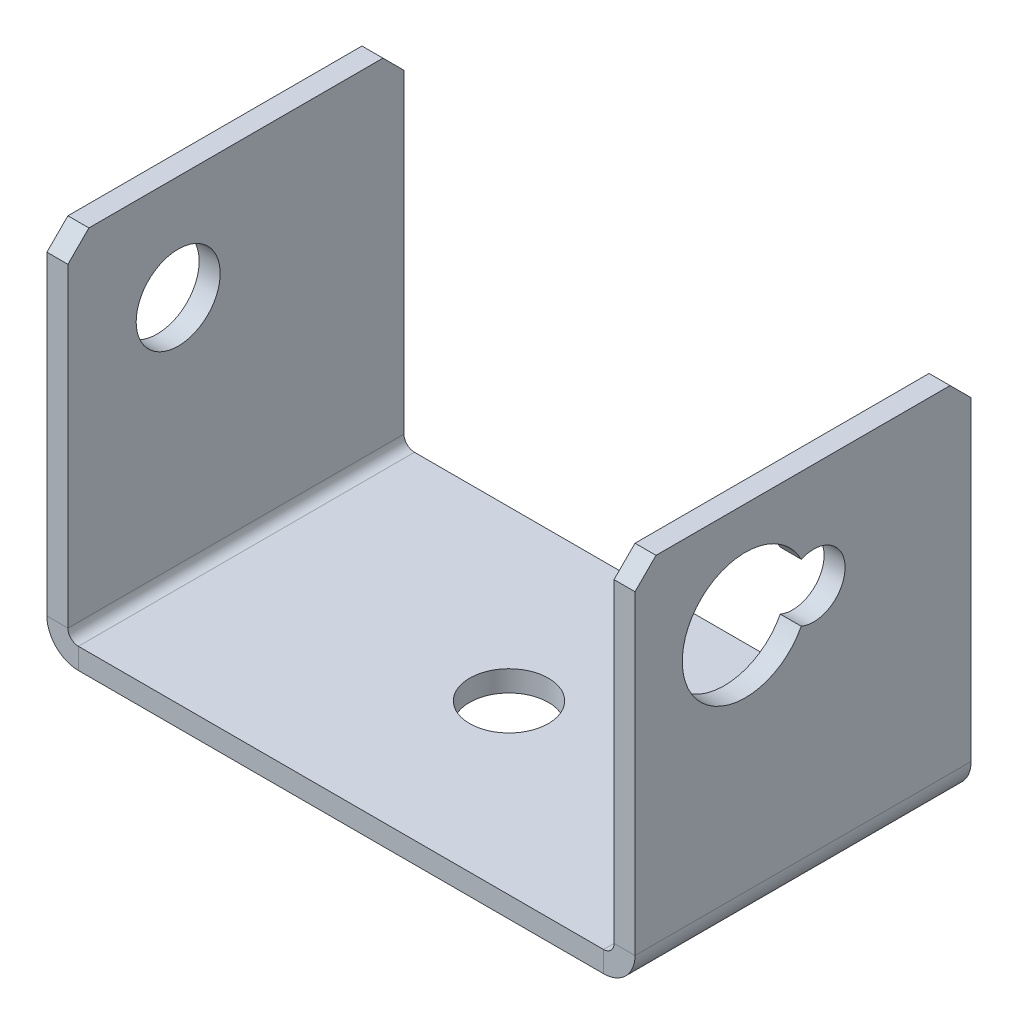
ISO-10303-21;
HEADER;
FILE_DESCRIPTION(('STEP AP214'),'2;1');
FILE_NAME('part.step','',(''),(''),'','','');
FILE_SCHEMA(('AUTOMOTIVE_DESIGN { 1 0 10303 214 1 1 1 1 }'));
ENDSEC;
DATA;
#1=APPLICATION_CONTEXT('core data for automotive mechanical design processes');
#2=APPLICATION_PROTOCOL_DEFINITION('international standard','automotive_design',2000,#1);
#3=PRODUCT_CONTEXT('',#1,'mechanical');
#4=PRODUCT('Part','Part','',(#3));
#5=PRODUCT_RELATED_PRODUCT_CATEGORY('part','',(#4));
#6=PRODUCT_DEFINITION_FORMATION('','',#4);
#7=PRODUCT_DEFINITION_CONTEXT('part definition',#1,'design');
#8=PRODUCT_DEFINITION('design','',#6,#7);
#9=PRODUCT_DEFINITION_SHAPE('','',#8);
#10=(LENGTH_UNIT() NAMED_UNIT(*) SI_UNIT(.MILLI.,.METRE.));
#11=(NAMED_UNIT(*) PLANE_ANGLE_UNIT() SI_UNIT($,.RADIAN.));
#12=(NAMED_UNIT(*) SI_UNIT($,.STERADIAN.) SOLID_ANGLE_UNIT());
#13=UNCERTAINTY_MEASURE_WITH_UNIT(LENGTH_MEASURE(1.E-05),#10,'distance_accuracy_value','');
#14=(GEOMETRIC_REPRESENTATION_CONTEXT(3) GLOBAL_UNCERTAINTY_ASSIGNED_CONTEXT((#13)) GLOBAL_UNIT_ASSIGNED_CONTEXT((#10,
#11,#12)) REPRESENTATION_CONTEXT('',''));
#15=CARTESIAN_POINT('',(0.,0.,0.));
#16=DIRECTION('',(0.,0.,1.));
#17=DIRECTION('',(1.,0.,0.));
#18=AXIS2_PLACEMENT_3D('',#15,#16,#17);
#19=CARTESIAN_POINT('',(3.,0.,-32.));
#20=DIRECTION('',(0.,0.,-1.));
#21=DIRECTION('',(-1.,0.,0.));
#22=AXIS2_PLACEMENT_3D('',#19,#20,#21);
#23=PLANE('',#22);
#24=DIRECTION('',(0.,1.,0.));
#25=VECTOR('',#24,1.);
#26=CARTESIAN_POINT('',(3.,0.,-32.));
#27=LINE('',#26,#25);
#28=CARTESIAN_POINT('',(3.,0.,-32.));
#29=VERTEX_POINT('',#28);
#30=CARTESIAN_POINT('',(3.,2.,-32.));
#31=VERTEX_POINT('',#30);
#32=EDGE_CURVE('E305',#29,#31,#27,.T.);
#33=ORIENTED_EDGE('',*,*,#32,.F.);
#34=CARTESIAN_POINT('',(3.,3.,-32.));
#35=DIRECTION('',(0.,0.,-1.));
#36=DIRECTION('',(-1.,0.,0.));
#37=AXIS2_PLACEMENT_3D('',#34,#35,#36);
#38=CIRCLE('',#37,3.);
#39=CARTESIAN_POINT('',(0.,3.,-32.));
#40=VERTEX_POINT('',#39);
#41=EDGE_CURVE('E220',#40,#29,#38,.F.);
#42=ORIENTED_EDGE('',*,*,#41,.F.);
#43=DIRECTION('',(-1.,0.,0.));
#44=VECTOR('',#43,1.);
#45=CARTESIAN_POINT('',(2.,3.,-32.));
#46=LINE('',#45,#44);
#47=CARTESIAN_POINT('',(2.,3.,-32.));
#48=VERTEX_POINT('',#47);
#49=EDGE_CURVE('E302',#48,#40,#46,.T.);
#50=ORIENTED_EDGE('',*,*,#49,.F.);
#51=CARTESIAN_POINT('',(3.,3.,-32.));
#52=DIRECTION('',(0.,0.,1.));
#53=DIRECTION('',(1.,0.,0.));
#54=AXIS2_PLACEMENT_3D('',#51,#52,#53);
#55=CIRCLE('',#54,1.);
#56=EDGE_CURVE('E213',#48,#31,#55,.T.);
#57=ORIENTED_EDGE('',*,*,#56,.T.);
#58=EDGE_LOOP('',(#33,#42,#50,#57));
#59=FACE_BOUND('',#58,.T.);
#60=ADVANCED_FACE('F42',(#59),#23,.T.);
#61=CARTESIAN_POINT('',(2.,3.,-32.));
#62=DIRECTION('',(0.,0.,-1.));
#63=DIRECTION('',(-1.,0.,0.));
#64=AXIS2_PLACEMENT_3D('',#61,#62,#63);
#65=PLANE('',#64);
#66=DIRECTION('',(1.,0.,0.));
#67=VECTOR('',#66,1.);
#68=CARTESIAN_POINT('',(0.,0.,-32.));
#69=LINE('',#68,#67);
#70=CARTESIAN_POINT('',(53.,0.,-32.));
#71=VERTEX_POINT('',#70);
#72=EDGE_CURVE('E223',#29,#71,#69,.T.);
#73=ORIENTED_EDGE('',*,*,#72,.F.);
#74=ORIENTED_EDGE('',*,*,#32,.T.);
#75=DIRECTION('',(1.,0.,0.));
#76=VECTOR('',#75,1.);
#77=CARTESIAN_POINT('',(0.,2.,-32.));
#78=LINE('',#77,#76);
#79=CARTESIAN_POINT('',(53.,2.,-32.));
#80=VERTEX_POINT('',#79);
#81=EDGE_CURVE('E210',#31,#80,#78,.T.);
#82=ORIENTED_EDGE('',*,*,#81,.T.);
#83=DIRECTION('',(0.,-1.,0.));
#84=VECTOR('',#83,1.);
#85=CARTESIAN_POINT('',(53.,2.,-32.));
#86=LINE('',#85,#84);
#87=EDGE_CURVE('E293',#80,#71,#86,.T.);
#88=ORIENTED_EDGE('',*,*,#87,.T.);
#89=EDGE_LOOP('',(#73,#74,#82,#88));
#90=FACE_BOUND('',#89,.T.);
#91=ADVANCED_FACE('F368',(#90),#65,.T.);
#92=CARTESIAN_POINT('',(0.,3.,0.));
#93=DIRECTION('',(0.,0.,1.));
#94=DIRECTION('',(1.,0.,0.));
#95=AXIS2_PLACEMENT_3D('',#92,#93,#94);
#96=PLANE('',#95);
#97=DIRECTION('',(1.,0.,0.));
#98=VECTOR('',#97,1.);
#99=CARTESIAN_POINT('',(0.,3.,0.));
#100=LINE('',#99,#98);
#101=CARTESIAN_POINT('',(0.,3.,0.));
#102=VERTEX_POINT('',#101);
#103=CARTESIAN_POINT('',(2.,3.,0.));
#104=VERTEX_POINT('',#103);
#105=EDGE_CURVE('E299',#102,#104,#100,.T.);
#106=ORIENTED_EDGE('',*,*,#105,.F.);
#107=CARTESIAN_POINT('',(3.,3.,0.));
#108=DIRECTION('',(0.,0.,-1.));
#109=DIRECTION('',(-1.,0.,0.));
#110=AXIS2_PLACEMENT_3D('',#107,#108,#109);
#111=CIRCLE('',#110,3.);
#112=CARTESIAN_POINT('',(3.,0.,0.));
#113=VERTEX_POINT('',#112);
#114=EDGE_CURVE('E246',#102,#113,#111,.F.);
#115=ORIENTED_EDGE('',*,*,#114,.T.);
#116=DIRECTION('',(0.,-1.,0.));
#117=VECTOR('',#116,1.);
#118=CARTESIAN_POINT('',(3.,2.,0.));
#119=LINE('',#118,#117);
#120=CARTESIAN_POINT('',(3.,2.,0.));
#121=VERTEX_POINT('',#120);
#122=EDGE_CURVE('E297',#121,#113,#119,.T.);
#123=ORIENTED_EDGE('',*,*,#122,.F.);
#124=CARTESIAN_POINT('',(3.,3.,0.));
#125=DIRECTION('',(0.,0.,1.));
#126=DIRECTION('',(1.,0.,0.));
#127=AXIS2_PLACEMENT_3D('',#124,#125,#126);
#128=CIRCLE('',#127,1.);
#129=EDGE_CURVE('E239',#104,#121,#128,.T.);
#130=ORIENTED_EDGE('',*,*,#129,.F.);
#131=EDGE_LOOP('',(#106,#115,#123,#130));
#132=FACE_BOUND('',#131,.T.);
#133=ADVANCED_FACE('F374',(#132),#96,.T.);
#134=CARTESIAN_POINT('',(3.,2.,0.));
#135=DIRECTION('',(0.,0.,1.));
#136=DIRECTION('',(1.,0.,0.));
#137=AXIS2_PLACEMENT_3D('',#134,#135,#136);
#138=PLANE('',#137);
#139=DIRECTION('',(0.,1.,0.));
#140=VECTOR('',#139,1.);
#141=CARTESIAN_POINT('',(2.,0.,0.));
#142=LINE('',#141,#140);
#143=CARTESIAN_POINT('',(2.,33.,0.));
#144=VERTEX_POINT('',#143);
#145=EDGE_CURVE('E242',#144,#104,#142,.F.);
#146=ORIENTED_EDGE('',*,*,#145,.F.);
#147=DIRECTION('',(-1.,0.,0.));
#148=VECTOR('',#147,1.);
#149=CARTESIAN_POINT('',(0.,33.,0.));
#150=LINE('',#149,#148);
#151=CARTESIAN_POINT('',(0.,33.,0.));
#152=VERTEX_POINT('',#151);
#153=EDGE_CURVE('E326',#144,#152,#150,.T.);
#154=ORIENTED_EDGE('',*,*,#153,.T.);
#155=DIRECTION('',(0.,-1.,0.));
#156=VECTOR('',#155,1.);
#157=CARTESIAN_POINT('',(0.,0.,0.));
#158=LINE('',#157,#156);
#159=EDGE_CURVE('E244',#152,#102,#158,.T.);
#160=ORIENTED_EDGE('',*,*,#159,.T.);
#161=ORIENTED_EDGE('',*,*,#105,.T.);
#162=EDGE_LOOP('',(#146,#154,#160,#161));
#163=FACE_BOUND('',#162,.T.);
#164=ADVANCED_FACE('F449',(#163),#138,.T.);
#165=CARTESIAN_POINT('',(56.,3.,-32.));
#166=DIRECTION('',(0.,0.,-1.));
#167=DIRECTION('',(-1.,0.,0.));
#168=AXIS2_PLACEMENT_3D('',#165,#166,#167);
#169=PLANE('',#168);
#170=DIRECTION('',(-1.,0.,0.));
#171=VECTOR('',#170,1.);
#172=CARTESIAN_POINT('',(56.,3.,-32.));
#173=LINE('',#172,#171);
#174=CARTESIAN_POINT('',(56.,3.,-32.));
#175=VERTEX_POINT('',#174);
#176=CARTESIAN_POINT('',(54.,3.,-32.));
#177=VERTEX_POINT('',#176);
#178=EDGE_CURVE('E295',#175,#177,#173,.T.);
#179=ORIENTED_EDGE('',*,*,#178,.F.);
#180=CARTESIAN_POINT('',(53.,3.,-32.));
#181=DIRECTION('',(0.,0.,-1.));
#182=DIRECTION('',(-1.,0.,0.));
#183=AXIS2_PLACEMENT_3D('',#180,#181,#182);
#184=CIRCLE('',#183,3.);
#185=EDGE_CURVE('E226',#71,#175,#184,.F.);
#186=ORIENTED_EDGE('',*,*,#185,.F.);
#187=ORIENTED_EDGE('',*,*,#87,.F.);
#188=CARTESIAN_POINT('',(53.,3.,-32.));
#189=DIRECTION('',(0.,0.,1.));
#190=DIRECTION('',(1.,0.,0.));
#191=AXIS2_PLACEMENT_3D('',#188,#189,#190);
#192=CIRCLE('',#191,1.);
#193=EDGE_CURVE('E207',#80,#177,#192,.T.);
#194=ORIENTED_EDGE('',*,*,#193,.T.);
#195=EDGE_LOOP('',(#179,#186,#187,#194));
#196=FACE_BOUND('',#195,.T.);
#197=ADVANCED_FACE('F447',(#196),#169,.T.);
#198=CARTESIAN_POINT('',(53.,2.,-32.));
#199=DIRECTION('',(0.,0.,-1.));
#200=DIRECTION('',(-1.,0.,0.));
#201=AXIS2_PLACEMENT_3D('',#198,#199,#200);
#202=PLANE('',#201);
#203=DIRECTION('',(0.,1.,0.));
#204=VECTOR('',#203,1.);
#205=CARTESIAN_POINT('',(54.,0.,-32.));
#206=LINE('',#205,#204);
#207=CARTESIAN_POINT('',(54.,33.,-32.));
#208=VERTEX_POINT('',#207);
#209=EDGE_CURVE('E204',#177,#208,#206,.T.);
#210=ORIENTED_EDGE('',*,*,#209,.T.);
#211=DIRECTION('',(1.,0.,0.));
#212=VECTOR('',#211,1.);
#213=CARTESIAN_POINT('',(56.,33.,-32.));
#214=LINE('',#213,#212);
#215=CARTESIAN_POINT('',(56.,33.,-32.));
#216=VERTEX_POINT('',#215);
#217=EDGE_CURVE('E11',#208,#216,#214,.T.);
#218=ORIENTED_EDGE('',*,*,#217,.T.);
#219=DIRECTION('',(0.,1.,0.));
#220=VECTOR('',#219,1.);
#221=CARTESIAN_POINT('',(56.,0.,-32.));
#222=LINE('',#221,#220);
#223=EDGE_CURVE('E201',#175,#216,#222,.T.);
#224=ORIENTED_EDGE('',*,*,#223,.F.);
#225=ORIENTED_EDGE('',*,*,#178,.T.);
#226=EDGE_LOOP('',(#210,#218,#224,#225));
#227=FACE_BOUND('',#226,.T.);
#228=ADVANCED_FACE('F359',(#227),#202,.T.);
#229=CARTESIAN_POINT('',(53.,0.,0.));
#230=DIRECTION('',(0.,0.,1.));
#231=DIRECTION('',(1.,0.,0.));
#232=AXIS2_PLACEMENT_3D('',#229,#230,#231);
#233=PLANE('',#232);
#234=DIRECTION('',(0.,1.,0.));
#235=VECTOR('',#234,1.);
#236=CARTESIAN_POINT('',(53.,0.,0.));
#237=LINE('',#236,#235);
#238=CARTESIAN_POINT('',(53.,0.,0.));
#239=VERTEX_POINT('',#238);
#240=CARTESIAN_POINT('',(53.,2.,0.));
#241=VERTEX_POINT('',#240);
#242=EDGE_CURVE('E291',#239,#241,#237,.T.);
#243=ORIENTED_EDGE('',*,*,#242,.F.);
#244=CARTESIAN_POINT('',(53.,3.,0.));
#245=DIRECTION('',(0.,0.,-1.));
#246=DIRECTION('',(-1.,0.,0.));
#247=AXIS2_PLACEMENT_3D('',#244,#245,#246);
#248=CIRCLE('',#247,3.);
#249=CARTESIAN_POINT('',(56.,3.,0.));
#250=VERTEX_POINT('',#249);
#251=EDGE_CURVE('E205',#239,#250,#248,.F.);
#252=ORIENTED_EDGE('',*,*,#251,.T.);
#253=DIRECTION('',(1.,0.,0.));
#254=VECTOR('',#253,1.);
#255=CARTESIAN_POINT('',(54.,3.,0.));
#256=LINE('',#255,#254);
#257=CARTESIAN_POINT('',(54.,3.,0.));
#258=VERTEX_POINT('',#257);
#259=EDGE_CURVE('E257',#258,#250,#256,.T.);
#260=ORIENTED_EDGE('',*,*,#259,.F.);
#261=CARTESIAN_POINT('',(53.,3.,0.));
#262=DIRECTION('',(0.,0.,1.));
#263=DIRECTION('',(1.,0.,0.));
#264=AXIS2_PLACEMENT_3D('',#261,#262,#263);
#265=CIRCLE('',#264,1.);
#266=EDGE_CURVE('E233',#241,#258,#265,.T.);
#267=ORIENTED_EDGE('',*,*,#266,.F.);
#268=EDGE_LOOP('',(#243,#252,#260,#267));
#269=FACE_BOUND('',#268,.T.);
#270=ADVANCED_FACE('F455',(#269),#233,.T.);
#271=CARTESIAN_POINT('',(54.,3.,0.));
#272=DIRECTION('',(0.,0.,1.));
#273=DIRECTION('',(1.,0.,0.));
#274=AXIS2_PLACEMENT_3D('',#271,#272,#273);
#275=PLANE('',#274);
#276=DIRECTION('',(1.,0.,0.));
#277=VECTOR('',#276,1.);
#278=CARTESIAN_POINT('',(0.,0.,0.));
#279=LINE('',#278,#277);
#280=EDGE_CURVE('E249',#113,#239,#279,.T.);
#281=ORIENTED_EDGE('',*,*,#280,.T.);
#282=ORIENTED_EDGE('',*,*,#242,.T.);
#283=DIRECTION('',(1.,0.,0.));
#284=VECTOR('',#283,1.);
#285=CARTESIAN_POINT('',(0.,2.,0.));
#286=LINE('',#285,#284);
#287=EDGE_CURVE('E236',#121,#241,#286,.T.);
#288=ORIENTED_EDGE('',*,*,#287,.F.);
#289=ORIENTED_EDGE('',*,*,#122,.T.);
#290=EDGE_LOOP('',(#281,#282,#288,#289));
#291=FACE_BOUND('',#290,.T.);
#292=ADVANCED_FACE('F434',(#291),#275,.T.);
#293=CARTESIAN_POINT('',(56.,0.,-32.));
#294=DIRECTION('',(1.,0.,0.));
#295=DIRECTION('',(0.,0.,-1.));
#296=AXIS2_PLACEMENT_3D('',#293,#294,#295);
#297=PLANE('',#296);
#298=CARTESIAN_POINT('',(56.,25.,-17.));
#299=DIRECTION('',(1.,0.,0.));
#300=DIRECTION('',(0.,0.,-1.));
#301=AXIS2_PLACEMENT_3D('',#298,#299,#300);
#302=CIRCLE('',#301,2.99999999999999);
#303=CARTESIAN_POINT('',(56.,22.238860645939,-15.8269230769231));
#304=VERTEX_POINT('',#303);
#305=CARTESIAN_POINT('',(56.,27.761139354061,-15.8269230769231));
#306=VERTEX_POINT('',#305);
#307=EDGE_CURVE('E176',#304,#306,#302,.T.);
#308=ORIENTED_EDGE('',*,*,#307,.F.);
#309=CARTESIAN_POINT('',(56.,25.,-10.5));
#310=DIRECTION('',(1.,0.,0.));
#311=DIRECTION('',(0.,0.,-1.));
#312=AXIS2_PLACEMENT_3D('',#309,#310,#311);
#313=CIRCLE('',#312,6.);
#314=EDGE_CURVE('E186',#306,#304,#313,.T.);
#315=ORIENTED_EDGE('',*,*,#314,.F.);
#316=EDGE_LOOP('',(#308,#315));
#317=FACE_BOUND('',#316,.T.);
#318=DIRECTION('',(0.,0.,1.));
#319=VECTOR('',#318,1.);
#320=CARTESIAN_POINT('',(56.,35.,-32.));
#321=LINE('',#320,#319);
#322=CARTESIAN_POINT('',(56.,35.,-30.));
#323=VERTEX_POINT('',#322);
#324=CARTESIAN_POINT('',(56.,35.,-2.));
#325=VERTEX_POINT('',#324);
#326=EDGE_CURVE('E229',#323,#325,#321,.T.);
#327=ORIENTED_EDGE('',*,*,#326,.T.);
#328=DIRECTION('',(0.,-0.707106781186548,0.707106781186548));
#329=VECTOR('',#328,1.);
#330=CARTESIAN_POINT('',(56.,32.5,0.5));
#331=LINE('',#330,#329);
#332=CARTESIAN_POINT('',(56.,33.,0.));
#333=VERTEX_POINT('',#332);
#334=EDGE_CURVE('E335',#325,#333,#331,.T.);
#335=ORIENTED_EDGE('',*,*,#334,.T.);
#336=DIRECTION('',(0.,1.,0.));
#337=VECTOR('',#336,1.);
#338=CARTESIAN_POINT('',(56.,0.,0.));
#339=LINE('',#338,#337);
#340=EDGE_CURVE('E182',#250,#333,#339,.T.);
#341=ORIENTED_EDGE('',*,*,#340,.F.);
#342=DIRECTION('',(0.,0.,1.));
#343=VECTOR('',#342,1.);
#344=CARTESIAN_POINT('',(56.,3.,-32.));
#345=LINE('',#344,#343);
#346=EDGE_CURVE('E254',#175,#250,#345,.T.);
#347=ORIENTED_EDGE('',*,*,#346,.F.);
#348=ORIENTED_EDGE('',*,*,#223,.T.);
#349=DIRECTION('',(0.,0.707106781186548,0.707106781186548));
#350=VECTOR('',#349,1.);
#351=CARTESIAN_POINT('',(56.,16.5,-48.5));
#352=LINE('',#351,#350);
#353=EDGE_CURVE('E333',#216,#323,#352,.T.);
#354=ORIENTED_EDGE('',*,*,#353,.T.);
#355=EDGE_LOOP('',(#327,#335,#341,#347,#348,#354));
#356=FACE_BOUND('',#355,.T.);
#357=ADVANCED_FACE('F190',(#317,#356),#297,.T.);
#358=CARTESIAN_POINT('',(53.,3.,-32.));
#359=DIRECTION('',(0.,0.,1.));
#360=DIRECTION('',(1.,0.,0.));
#361=AXIS2_PLACEMENT_3D('',#358,#359,#360);
#362=CYLINDRICAL_SURFACE('',#361,3.);
#363=ORIENTED_EDGE('',*,*,#251,.F.);
#364=DIRECTION('',(0.,0.,1.));
#365=VECTOR('',#364,1.);
#366=CARTESIAN_POINT('',(53.,0.,-32.));
#367=LINE('',#366,#365);
#368=EDGE_CURVE('E258',#71,#239,#367,.T.);
#369=ORIENTED_EDGE('',*,*,#368,.F.);
#370=ORIENTED_EDGE('',*,*,#185,.T.);
#371=ORIENTED_EDGE('',*,*,#346,.T.);
#372=EDGE_LOOP('',(#363,#369,#370,#371));
#373=FACE_BOUND('',#372,.T.);
#374=ADVANCED_FACE('F354',(#373),#362,.T.);
#375=CARTESIAN_POINT('',(0.,0.,-32.));
#376=DIRECTION('',(0.,-1.,0.));
#377=DIRECTION('',(0.,0.,-1.));
#378=AXIS2_PLACEMENT_3D('',#375,#376,#377);
#379=PLANE('',#378);
#380=CARTESIAN_POINT('',(28.,0.,-16.));
#381=DIRECTION('',(0.,-1.,0.));
#382=DIRECTION('',(0.,0.,-1.));
#383=AXIS2_PLACEMENT_3D('',#380,#381,#382);
#384=CIRCLE('',#383,3.75);
#385=CARTESIAN_POINT('',(28.,0.,-19.75));
#386=VERTEX_POINT('',#385);
#387=EDGE_CURVE('E795',#386,#386,#384,.T.);
#388=ORIENTED_EDGE('',*,*,#387,.F.);
#389=EDGE_LOOP('',(#388));
#390=FACE_BOUND('',#389,.T.);
#391=ORIENTED_EDGE('',*,*,#280,.F.);
#392=DIRECTION('',(0.,0.,1.));
#393=VECTOR('',#392,1.);
#394=CARTESIAN_POINT('',(3.,0.,-32.));
#395=LINE('',#394,#393);
#396=EDGE_CURVE('E261',#29,#113,#395,.T.);
#397=ORIENTED_EDGE('',*,*,#396,.F.);
#398=ORIENTED_EDGE('',*,*,#72,.T.);
#399=ORIENTED_EDGE('',*,*,#368,.T.);
#400=EDGE_LOOP('',(#391,#397,#398,#399));
#401=FACE_BOUND('',#400,.T.);
#402=ADVANCED_FACE('F429',(#390,#401),#379,.T.);
#403=CARTESIAN_POINT('',(3.,3.,-32.));
#404=DIRECTION('',(0.,0.,1.));
#405=DIRECTION('',(1.,0.,0.));
#406=AXIS2_PLACEMENT_3D('',#403,#404,#405);
#407=CYLINDRICAL_SURFACE('',#406,3.);
#408=ORIENTED_EDGE('',*,*,#114,.F.);
#409=DIRECTION('',(0.,0.,1.));
#410=VECTOR('',#409,1.);
#411=CARTESIAN_POINT('',(0.,3.,-32.));
#412=LINE('',#411,#410);
#413=EDGE_CURVE('E264',#40,#102,#412,.T.);
#414=ORIENTED_EDGE('',*,*,#413,.F.);
#415=ORIENTED_EDGE('',*,*,#41,.T.);
#416=ORIENTED_EDGE('',*,*,#396,.T.);
#417=EDGE_LOOP('',(#408,#414,#415,#416));
#418=FACE_BOUND('',#417,.T.);
#419=ADVANCED_FACE('F422',(#418),#407,.T.);
#420=CARTESIAN_POINT('',(0.,0.,-32.));
#421=DIRECTION('',(-1.,0.,0.));
#422=DIRECTION('',(0.,0.,1.));
#423=AXIS2_PLACEMENT_3D('',#420,#421,#422);
#424=PLANE('',#423);
#425=CARTESIAN_POINT('',(0.,25.,-10.5));
#426=DIRECTION('',(-1.,0.,0.));
#427=DIRECTION('',(0.,0.,1.));
#428=AXIS2_PLACEMENT_3D('',#425,#426,#427);
#429=CIRCLE('',#428,4.);
#430=CARTESIAN_POINT('',(0.,25.,-6.5));
#431=VERTEX_POINT('',#430);
#432=EDGE_CURVE('E195',#431,#431,#429,.T.);
#433=ORIENTED_EDGE('',*,*,#432,.F.);
#434=EDGE_LOOP('',(#433));
#435=FACE_BOUND('',#434,.T.);
#436=DIRECTION('',(0.,0.,1.));
#437=VECTOR('',#436,1.);
#438=CARTESIAN_POINT('',(0.,35.,-32.));
#439=LINE('',#438,#437);
#440=CARTESIAN_POINT('',(0.,35.,-30.));
#441=VERTEX_POINT('',#440);
#442=CARTESIAN_POINT('',(0.,35.,-2.));
#443=VERTEX_POINT('',#442);
#444=EDGE_CURVE('E267',#441,#443,#439,.T.);
#445=ORIENTED_EDGE('',*,*,#444,.F.);
#446=DIRECTION('',(0.,0.707106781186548,0.707106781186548));
#447=VECTOR('',#446,1.);
#448=CARTESIAN_POINT('',(0.,16.5,-48.5));
#449=LINE('',#448,#447);
#450=CARTESIAN_POINT('',(0.,33.,-32.));
#451=VERTEX_POINT('',#450);
#452=EDGE_CURVE('E324',#441,#451,#449,.F.);
#453=ORIENTED_EDGE('',*,*,#452,.T.);
#454=DIRECTION('',(0.,-1.,0.));
#455=VECTOR('',#454,1.);
#456=CARTESIAN_POINT('',(0.,0.,-32.));
#457=LINE('',#456,#455);
#458=EDGE_CURVE('E218',#451,#40,#457,.T.);
#459=ORIENTED_EDGE('',*,*,#458,.T.);
#460=ORIENTED_EDGE('',*,*,#413,.T.);
#461=ORIENTED_EDGE('',*,*,#159,.F.);
#462=DIRECTION('',(0.,0.707106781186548,-0.707106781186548));
#463=VECTOR('',#462,1.);
#464=CARTESIAN_POINT('',(0.,32.5,0.5));
#465=LINE('',#464,#463);
#466=EDGE_CURVE('E322',#152,#443,#465,.T.);
#467=ORIENTED_EDGE('',*,*,#466,.T.);
#468=EDGE_LOOP('',(#445,#453,#459,#460,#461,#467));
#469=FACE_BOUND('',#468,.T.);
#470=ADVANCED_FACE('F405',(#435,#469),#424,.T.);
#471=CARTESIAN_POINT('',(0.,35.,-32.));
#472=DIRECTION('',(0.,-1.,0.));
#473=DIRECTION('',(0.,0.,-1.));
#474=AXIS2_PLACEMENT_3D('',#471,#472,#473);
#475=PLANE('',#474);
#476=DIRECTION('',(0.,0.,1.));
#477=VECTOR('',#476,1.);
#478=CARTESIAN_POINT('',(2.,35.,-32.));
#479=LINE('',#478,#477);
#480=CARTESIAN_POINT('',(2.,35.,-30.));
#481=VERTEX_POINT('',#480);
#482=CARTESIAN_POINT('',(2.,35.,-2.));
#483=VERTEX_POINT('',#482);
#484=EDGE_CURVE('E270',#481,#483,#479,.T.);
#485=ORIENTED_EDGE('',*,*,#484,.F.);
#486=DIRECTION('',(-1.,0.,0.));
#487=VECTOR('',#486,1.);
#488=CARTESIAN_POINT('',(0.,35.,-30.));
#489=LINE('',#488,#487);
#490=EDGE_CURVE('E320',#481,#441,#489,.T.);
#491=ORIENTED_EDGE('',*,*,#490,.T.);
#492=ORIENTED_EDGE('',*,*,#444,.T.);
#493=DIRECTION('',(1.,0.,0.));
#494=VECTOR('',#493,1.);
#495=CARTESIAN_POINT('',(2.,35.,-2.));
#496=LINE('',#495,#494);
#497=EDGE_CURVE('E317',#443,#483,#496,.T.);
#498=ORIENTED_EDGE('',*,*,#497,.T.);
#499=EDGE_LOOP('',(#485,#491,#492,#498));
#500=FACE_BOUND('',#499,.T.);
#501=ADVANCED_FACE('F409',(#500),#475,.F.);
#502=CARTESIAN_POINT('',(2.,0.,-32.));
#503=DIRECTION('',(-1.,0.,0.));
#504=DIRECTION('',(0.,0.,1.));
#505=AXIS2_PLACEMENT_3D('',#502,#503,#504);
#506=PLANE('',#505);
#507=CARTESIAN_POINT('',(2.,25.,-10.5));
#508=DIRECTION('',(-1.,0.,0.));
#509=DIRECTION('',(0.,0.,1.));
#510=AXIS2_PLACEMENT_3D('',#507,#508,#509);
#511=CIRCLE('',#510,4.);
#512=CARTESIAN_POINT('',(2.,25.,-6.5));
#513=VERTEX_POINT('',#512);
#514=EDGE_CURVE('E192',#513,#513,#511,.T.);
#515=ORIENTED_EDGE('',*,*,#514,.T.);
#516=EDGE_LOOP('',(#515));
#517=FACE_BOUND('',#516,.T.);
#518=DIRECTION('',(0.,1.,0.));
#519=VECTOR('',#518,1.);
#520=CARTESIAN_POINT('',(2.,0.,-32.));
#521=LINE('',#520,#519);
#522=CARTESIAN_POINT('',(2.,33.,-32.));
#523=VERTEX_POINT('',#522);
#524=EDGE_CURVE('E216',#523,#48,#521,.F.);
#525=ORIENTED_EDGE('',*,*,#524,.F.);
#526=DIRECTION('',(0.,-0.707106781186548,-0.707106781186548));
#527=VECTOR('',#526,1.);
#528=CARTESIAN_POINT('',(2.,33.,-32.));
#529=LINE('',#528,#527);
#530=EDGE_CURVE('E315',#523,#481,#529,.F.);
#531=ORIENTED_EDGE('',*,*,#530,.T.);
#532=ORIENTED_EDGE('',*,*,#484,.T.);
#533=DIRECTION('',(0.,-0.707106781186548,0.707106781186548));
#534=VECTOR('',#533,1.);
#535=CARTESIAN_POINT('',(2.,35.,-2.));
#536=LINE('',#535,#534);
#537=EDGE_CURVE('E313',#483,#144,#536,.T.);
#538=ORIENTED_EDGE('',*,*,#537,.T.);
#539=ORIENTED_EDGE('',*,*,#145,.T.);
#540=DIRECTION('',(0.,0.,1.));
#541=VECTOR('',#540,1.);
#542=CARTESIAN_POINT('',(2.,3.,-32.));
#543=LINE('',#542,#541);
#544=EDGE_CURVE('E273',#48,#104,#543,.T.);
#545=ORIENTED_EDGE('',*,*,#544,.F.);
#546=EDGE_LOOP('',(#525,#531,#532,#538,#539,#545));
#547=FACE_BOUND('',#546,.T.);
#548=ADVANCED_FACE('F519',(#517,#547),#506,.F.);
#549=CARTESIAN_POINT('',(3.,3.,-32.));
#550=DIRECTION('',(0.,0.,1.));
#551=DIRECTION('',(1.,0.,0.));
#552=AXIS2_PLACEMENT_3D('',#549,#550,#551);
#553=CYLINDRICAL_SURFACE('',#552,1.);
#554=ORIENTED_EDGE('',*,*,#129,.T.);
#555=DIRECTION('',(0.,0.,1.));
#556=VECTOR('',#555,1.);
#557=CARTESIAN_POINT('',(3.,2.,-32.));
#558=LINE('',#557,#556);
#559=EDGE_CURVE('E276',#31,#121,#558,.T.);
#560=ORIENTED_EDGE('',*,*,#559,.F.);
#561=ORIENTED_EDGE('',*,*,#56,.F.);
#562=ORIENTED_EDGE('',*,*,#544,.T.);
#563=EDGE_LOOP('',(#554,#560,#561,#562));
#564=FACE_BOUND('',#563,.T.);
#565=ADVANCED_FACE('F440',(#564),#553,.F.);
#566=CARTESIAN_POINT('',(0.,2.,-32.));
#567=DIRECTION('',(0.,-1.,0.));
#568=DIRECTION('',(0.,0.,-1.));
#569=AXIS2_PLACEMENT_3D('',#566,#567,#568);
#570=PLANE('',#569);
#571=CARTESIAN_POINT('',(28.,2.,-16.));
#572=DIRECTION('',(0.,1.,0.));
#573=DIRECTION('',(0.,0.,1.));
#574=AXIS2_PLACEMENT_3D('',#571,#572,#573);
#575=CIRCLE('',#574,3.75);
#576=CARTESIAN_POINT('',(28.,2.,-12.25));
#577=VERTEX_POINT('',#576);
#578=EDGE_CURVE('E796',#577,#577,#575,.T.);
#579=ORIENTED_EDGE('',*,*,#578,.F.);
#580=EDGE_LOOP('',(#579));
#581=FACE_BOUND('',#580,.T.);
#582=ORIENTED_EDGE('',*,*,#287,.T.);
#583=DIRECTION('',(0.,0.,1.));
#584=VECTOR('',#583,1.);
#585=CARTESIAN_POINT('',(53.,2.,-32.));
#586=LINE('',#585,#584);
#587=EDGE_CURVE('E279',#80,#241,#586,.T.);
#588=ORIENTED_EDGE('',*,*,#587,.F.);
#589=ORIENTED_EDGE('',*,*,#81,.F.);
#590=ORIENTED_EDGE('',*,*,#559,.T.);
#591=EDGE_LOOP('',(#582,#588,#589,#590));
#592=FACE_BOUND('',#591,.T.);
#593=ADVANCED_FACE('F442',(#581,#592),#570,.F.);
#594=CARTESIAN_POINT('',(53.,3.,-32.));
#595=DIRECTION('',(0.,0.,1.));
#596=DIRECTION('',(1.,0.,0.));
#597=AXIS2_PLACEMENT_3D('',#594,#595,#596);
#598=CYLINDRICAL_SURFACE('',#597,1.);
#599=ORIENTED_EDGE('',*,*,#266,.T.);
#600=DIRECTION('',(0.,0.,1.));
#601=VECTOR('',#600,1.);
#602=CARTESIAN_POINT('',(54.,3.,-32.));
#603=LINE('',#602,#601);
#604=EDGE_CURVE('E282',#177,#258,#603,.T.);
#605=ORIENTED_EDGE('',*,*,#604,.F.);
#606=ORIENTED_EDGE('',*,*,#193,.F.);
#607=ORIENTED_EDGE('',*,*,#587,.T.);
#608=EDGE_LOOP('',(#599,#605,#606,#607));
#609=FACE_BOUND('',#608,.T.);
#610=ADVANCED_FACE('F446',(#609),#598,.F.);
#611=CARTESIAN_POINT('',(54.,0.,-32.));
#612=DIRECTION('',(1.,0.,0.));
#613=DIRECTION('',(0.,0.,-1.));
#614=AXIS2_PLACEMENT_3D('',#611,#612,#613);
#615=PLANE('',#614);
#616=CARTESIAN_POINT('',(54.,25.,-10.5));
#617=DIRECTION('',(1.,0.,0.));
#618=DIRECTION('',(0.,0.,-1.));
#619=AXIS2_PLACEMENT_3D('',#616,#617,#618);
#620=CIRCLE('',#619,6.);
#621=CARTESIAN_POINT('',(54.,27.761139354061,-15.8269230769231));
#622=VERTEX_POINT('',#621);
#623=CARTESIAN_POINT('',(54.,22.238860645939,-15.8269230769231));
#624=VERTEX_POINT('',#623);
#625=EDGE_CURVE('E307',#622,#624,#620,.T.);
#626=ORIENTED_EDGE('',*,*,#625,.T.);
#627=CARTESIAN_POINT('',(54.,25.,-17.));
#628=DIRECTION('',(1.,0.,0.));
#629=DIRECTION('',(0.,0.,-1.));
#630=AXIS2_PLACEMENT_3D('',#627,#628,#629);
#631=CIRCLE('',#630,2.99999999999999);
#632=EDGE_CURVE('E179',#624,#622,#631,.T.);
#633=ORIENTED_EDGE('',*,*,#632,.T.);
#634=EDGE_LOOP('',(#626,#633));
#635=FACE_BOUND('',#634,.T.);
#636=DIRECTION('',(0.,1.,0.));
#637=VECTOR('',#636,1.);
#638=CARTESIAN_POINT('',(54.,0.,0.));
#639=LINE('',#638,#637);
#640=CARTESIAN_POINT('',(54.,33.,0.));
#641=VERTEX_POINT('',#640);
#642=EDGE_CURVE('E231',#258,#641,#639,.T.);
#643=ORIENTED_EDGE('',*,*,#642,.T.);
#644=DIRECTION('',(0.,0.707106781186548,-0.707106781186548));
#645=VECTOR('',#644,1.);
#646=CARTESIAN_POINT('',(54.,35.,-2.));
#647=LINE('',#646,#645);
#648=CARTESIAN_POINT('',(54.,35.,-2.));
#649=VERTEX_POINT('',#648);
#650=EDGE_CURVE('E51',#641,#649,#647,.T.);
#651=ORIENTED_EDGE('',*,*,#650,.T.);
#652=DIRECTION('',(0.,0.,1.));
#653=VECTOR('',#652,1.);
#654=CARTESIAN_POINT('',(54.,35.,-32.));
#655=LINE('',#654,#653);
#656=CARTESIAN_POINT('',(54.,35.,-30.));
#657=VERTEX_POINT('',#656);
#658=EDGE_CURVE('E285',#657,#649,#655,.T.);
#659=ORIENTED_EDGE('',*,*,#658,.F.);
#660=DIRECTION('',(0.,-0.707106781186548,-0.707106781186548));
#661=VECTOR('',#660,1.);
#662=CARTESIAN_POINT('',(54.,33.,-32.));
#663=LINE('',#662,#661);
#664=EDGE_CURVE('E58',#657,#208,#663,.T.);
#665=ORIENTED_EDGE('',*,*,#664,.T.);
#666=ORIENTED_EDGE('',*,*,#209,.F.);
#667=ORIENTED_EDGE('',*,*,#604,.T.);
#668=EDGE_LOOP('',(#643,#651,#659,#665,#666,#667));
#669=FACE_BOUND('',#668,.T.);
#670=ADVANCED_FACE('F339',(#635,#669),#615,.F.);
#671=CARTESIAN_POINT('',(54.,35.,-32.));
#672=DIRECTION('',(0.,-1.,0.));
#673=DIRECTION('',(0.,0.,-1.));
#674=AXIS2_PLACEMENT_3D('',#671,#672,#673);
#675=PLANE('',#674);
#676=ORIENTED_EDGE('',*,*,#658,.T.);
#677=DIRECTION('',(1.,0.,0.));
#678=VECTOR('',#677,1.);
#679=CARTESIAN_POINT('',(56.,35.,-2.));
#680=LINE('',#679,#678);
#681=EDGE_CURVE('E330',#649,#325,#680,.T.);
#682=ORIENTED_EDGE('',*,*,#681,.T.);
#683=ORIENTED_EDGE('',*,*,#326,.F.);
#684=DIRECTION('',(-1.,0.,0.));
#685=VECTOR('',#684,1.);
#686=CARTESIAN_POINT('',(54.,35.,-30.));
#687=LINE('',#686,#685);
#688=EDGE_CURVE('E328',#323,#657,#687,.T.);
#689=ORIENTED_EDGE('',*,*,#688,.T.);
#690=EDGE_LOOP('',(#676,#682,#683,#689));
#691=FACE_BOUND('',#690,.T.);
#692=ADVANCED_FACE('F343',(#691),#675,.F.);
#693=CARTESIAN_POINT('',(53.,3.,-32.));
#694=DIRECTION('',(0.,0.,1.));
#695=DIRECTION('',(1.,0.,0.));
#696=AXIS2_PLACEMENT_3D('',#693,#694,#695);
#697=PLANE('',#696);
#698=ORIENTED_EDGE('',*,*,#458,.F.);
#699=DIRECTION('',(1.,0.,0.));
#700=VECTOR('',#699,1.);
#701=CARTESIAN_POINT('',(53.,33.,-32.));
#702=LINE('',#701,#700);
#703=EDGE_CURVE('E309',#451,#523,#702,.T.);
#704=ORIENTED_EDGE('',*,*,#703,.T.);
#705=ORIENTED_EDGE('',*,*,#524,.T.);
#706=ORIENTED_EDGE('',*,*,#49,.T.);
#707=EDGE_LOOP('',(#698,#704,#705,#706));
#708=FACE_BOUND('',#707,.T.);
#709=ADVANCED_FACE('F414',(#708),#697,.F.);
#710=CARTESIAN_POINT('',(53.,3.,0.));
#711=DIRECTION('',(0.,0.,1.));
#712=DIRECTION('',(1.,0.,0.));
#713=AXIS2_PLACEMENT_3D('',#710,#711,#712);
#714=PLANE('',#713);
#715=ORIENTED_EDGE('',*,*,#340,.T.);
#716=DIRECTION('',(-1.,0.,0.));
#717=VECTOR('',#716,1.);
#718=CARTESIAN_POINT('',(54.,33.,0.));
#719=LINE('',#718,#717);
#720=EDGE_CURVE('E66',#333,#641,#719,.T.);
#721=ORIENTED_EDGE('',*,*,#720,.T.);
#722=ORIENTED_EDGE('',*,*,#642,.F.);
#723=ORIENTED_EDGE('',*,*,#259,.T.);
#724=EDGE_LOOP('',(#715,#721,#722,#723));
#725=FACE_BOUND('',#724,.T.);
#726=ADVANCED_FACE('F349',(#725),#714,.T.);
#727=CARTESIAN_POINT('',(46.,25.,-17.));
#728=DIRECTION('',(1.,0.,0.));
#729=DIRECTION('',(0.,0.,-1.));
#730=AXIS2_PLACEMENT_3D('',#727,#728,#729);
#731=CYLINDRICAL_SURFACE('',#730,2.99999999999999);
#732=DIRECTION('',(1.,0.,0.));
#733=VECTOR('',#732,1.);
#734=CARTESIAN_POINT('',(46.,22.238860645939,-15.8269230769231));
#735=LINE('',#734,#733);
#736=EDGE_CURVE('E171',#624,#304,#735,.T.);
#737=ORIENTED_EDGE('',*,*,#736,.T.);
#738=ORIENTED_EDGE('',*,*,#307,.T.);
#739=DIRECTION('',(1.,0.,0.));
#740=VECTOR('',#739,1.);
#741=CARTESIAN_POINT('',(46.,27.761139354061,-15.8269230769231));
#742=LINE('',#741,#740);
#743=EDGE_CURVE('E183',#622,#306,#742,.T.);
#744=ORIENTED_EDGE('',*,*,#743,.F.);
#745=ORIENTED_EDGE('',*,*,#632,.F.);
#746=EDGE_LOOP('',(#737,#738,#744,#745));
#747=FACE_BOUND('',#746,.T.);
#748=ADVANCED_FACE('F173',(#747),#731,.F.);
#749=CARTESIAN_POINT('',(46.,25.,-10.5));
#750=DIRECTION('',(1.,0.,0.));
#751=DIRECTION('',(0.,0.,-1.));
#752=AXIS2_PLACEMENT_3D('',#749,#750,#751);
#753=CYLINDRICAL_SURFACE('',#752,6.);
#754=ORIENTED_EDGE('',*,*,#743,.T.);
#755=ORIENTED_EDGE('',*,*,#314,.T.);
#756=ORIENTED_EDGE('',*,*,#736,.F.);
#757=ORIENTED_EDGE('',*,*,#625,.F.);
#758=EDGE_LOOP('',(#754,#755,#756,#757));
#759=FACE_BOUND('',#758,.T.);
#760=ADVANCED_FACE('F187',(#759),#753,.F.);
#761=CARTESIAN_POINT('',(10.,25.,-10.5));
#762=DIRECTION('',(-1.,0.,0.));
#763=DIRECTION('',(0.,0.,1.));
#764=AXIS2_PLACEMENT_3D('',#761,#762,#763);
#765=CYLINDRICAL_SURFACE('',#764,4.);
#766=ORIENTED_EDGE('',*,*,#432,.T.);
#767=EDGE_LOOP('',(#766));
#768=FACE_BOUND('',#767,.T.);
#769=ORIENTED_EDGE('',*,*,#514,.F.);
#770=EDGE_LOOP('',(#769));
#771=FACE_BOUND('',#770,.T.);
#772=ADVANCED_FACE('F609',(#768,#771),#765,.F.);
#773=CARTESIAN_POINT('',(28.,-8.,-16.));
#774=DIRECTION('',(0.,1.,0.));
#775=DIRECTION('',(0.,0.,1.));
#776=AXIS2_PLACEMENT_3D('',#773,#774,#775);
#777=CYLINDRICAL_SURFACE('',#776,3.75);
#778=ORIENTED_EDGE('',*,*,#387,.T.);
#779=EDGE_LOOP('',(#778));
#780=FACE_BOUND('',#779,.T.);
#781=ORIENTED_EDGE('',*,*,#578,.T.);
#782=EDGE_LOOP('',(#781));
#783=FACE_BOUND('',#782,.T.);
#784=ADVANCED_FACE('F386',(#780,#783),#777,.F.);
#785=CARTESIAN_POINT('',(53.,33.,-32.));
#786=DIRECTION('',(0.,-0.707106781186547,0.707106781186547));
#787=DIRECTION('',(1.,0.,0.));
#788=AXIS2_PLACEMENT_3D('',#785,#786,#787);
#789=PLANE('',#788);
#790=ORIENTED_EDGE('',*,*,#452,.F.);
#791=ORIENTED_EDGE('',*,*,#490,.F.);
#792=ORIENTED_EDGE('',*,*,#530,.F.);
#793=ORIENTED_EDGE('',*,*,#703,.F.);
#794=EDGE_LOOP('',(#790,#791,#792,#793));
#795=FACE_BOUND('',#794,.T.);
#796=ADVANCED_FACE('F380',(#795),#789,.F.);
#797=CARTESIAN_POINT('',(0.,35.,-2.));
#798=DIRECTION('',(0.,0.707106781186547,0.707106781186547));
#799=DIRECTION('',(-1.,0.,0.));
#800=AXIS2_PLACEMENT_3D('',#797,#798,#799);
#801=PLANE('',#800);
#802=ORIENTED_EDGE('',*,*,#466,.F.);
#803=ORIENTED_EDGE('',*,*,#153,.F.);
#804=ORIENTED_EDGE('',*,*,#537,.F.);
#805=ORIENTED_EDGE('',*,*,#497,.F.);
#806=EDGE_LOOP('',(#802,#803,#804,#805));
#807=FACE_BOUND('',#806,.T.);
#808=ADVANCED_FACE('F366',(#807),#801,.T.);
#809=CARTESIAN_POINT('',(54.,35.,-2.));
#810=DIRECTION('',(0.,0.707106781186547,0.707106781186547));
#811=DIRECTION('',(-1.,0.,0.));
#812=AXIS2_PLACEMENT_3D('',#809,#810,#811);
#813=PLANE('',#812);
#814=ORIENTED_EDGE('',*,*,#650,.F.);
#815=ORIENTED_EDGE('',*,*,#720,.F.);
#816=ORIENTED_EDGE('',*,*,#334,.F.);
#817=ORIENTED_EDGE('',*,*,#681,.F.);
#818=EDGE_LOOP('',(#814,#815,#816,#817));
#819=FACE_BOUND('',#818,.T.);
#820=ADVANCED_FACE('F346',(#819),#813,.T.);
#821=CARTESIAN_POINT('',(53.,33.,-32.));
#822=DIRECTION('',(0.,0.707106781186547,-0.707106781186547));
#823=DIRECTION('',(-1.,0.,0.));
#824=AXIS2_PLACEMENT_3D('',#821,#822,#823);
#825=PLANE('',#824);
#826=ORIENTED_EDGE('',*,*,#664,.F.);
#827=ORIENTED_EDGE('',*,*,#688,.F.);
#828=ORIENTED_EDGE('',*,*,#353,.F.);
#829=ORIENTED_EDGE('',*,*,#217,.F.);
#830=EDGE_LOOP('',(#826,#827,#828,#829));
#831=FACE_BOUND('',#830,.T.);
#832=ADVANCED_FACE('F45',(#831),#825,.T.);
#833=CLOSED_SHELL('',(#60,#91,#133,#164,#197,#228,#270,#292,#357,#374,#402,#419,#470,#501,#548,
#565,#593,#610,#670,#692,#709,#726,#748,#760,#772,#784,#796,#808,#820,#832));
#834=MANIFOLD_SOLID_BREP('B2',#833);
#835=ADVANCED_BREP_SHAPE_REPRESENTATION('',(#18,#834),#14);
#836=SHAPE_DEFINITION_REPRESENTATION(#9,#835);
ENDSEC;
END-ISO-10303-21;
